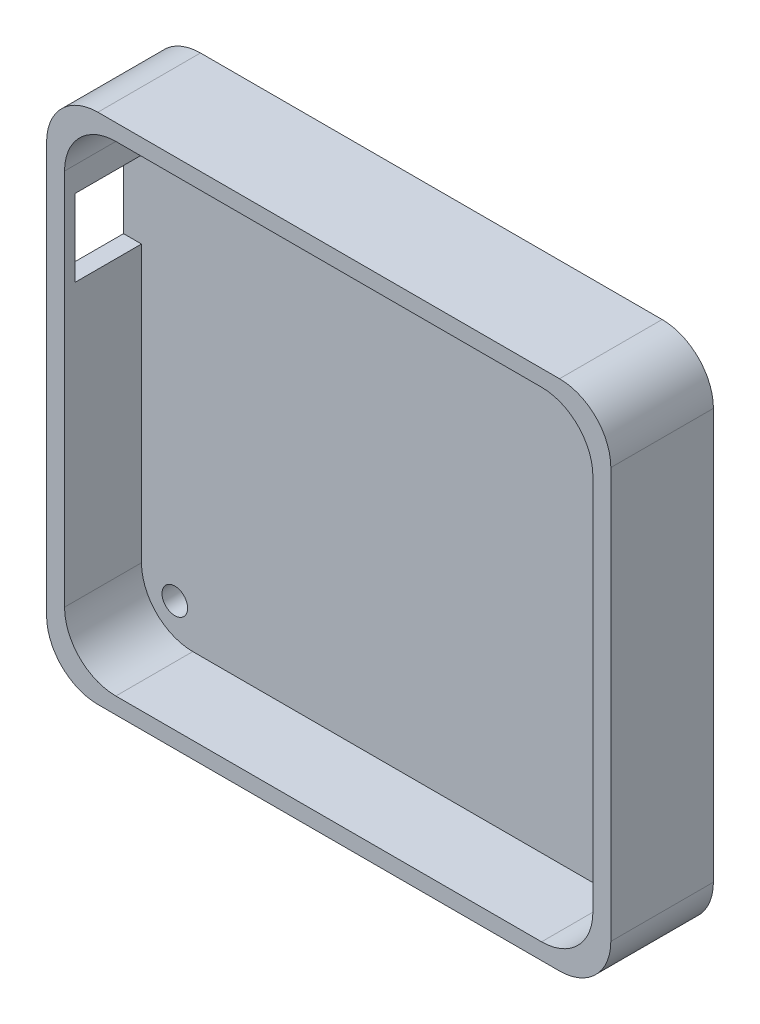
from build123d import *

# Parameters (mm, degrees)
SKETCH1_R           = 2.5
BOSS_EXTRUDE1_DEPTH = 5
BOSS_EXTRUDE2_DEPTH = 15
SKETCH4_W           = 13
SKETCH4_H           = 15
CUT_EXTRUDE1_DEPTH  = 6


with BuildPart() as part:
    # Sketch1 → Boss-Extrude1 (new body)
    with BuildSketch(Plane.XY):
        with BuildLine():
            Line((45, -50), (-45, -50))
            ThreePointArc((-45, -50), (-52.071067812, -47.071067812), (-55, -40))
            Line((-55, -40), (-55, 40))
            ThreePointArc((-55, 40), (-52.071067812, 47.071067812), (-45, 50))
            Line((-45, 50), (45, 50))
            ThreePointArc((45, 50), (52.071067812, 47.071067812), (55, 40))
            Line((55, 40), (55, -40))
            ThreePointArc((55, -40), (52.071067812, -47.071067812), (45, -50))
        make_face()
        with Locations((-45, 40)):
            Circle(SKETCH1_R, mode=Mode.SUBTRACT)
        with Locations(Location((-45, -40, 0), (0, 0, 180))):
            Circle(SKETCH1_R, mode=Mode.SUBTRACT)
        with Locations((45, -40)):
            Circle(SKETCH1_R, mode=Mode.SUBTRACT)
        with Locations(Location((45, 40, 0), (0, 0, 180))):
            Circle(SKETCH1_R, mode=Mode.SUBTRACT)
    extrude(amount=BOSS_EXTRUDE1_DEPTH)

    # Sketch2 → Boss-Extrude2 (add)
    with BuildSketch(Plane.XY.offset(5)):
        with BuildLine():
            Line((45, -50), (-45, -50))
            ThreePointArc((-45, -50), (-52.071067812, -47.071067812), (-55, -40))
            Line((-55, -40), (-55, 40))
            ThreePointArc((-55, 40), (-52.071067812, 47.071067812), (-45, 50))
            Line((-45, 50), (45, 50))
            ThreePointArc((45, 50), (52.071067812, 47.071067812), (55, 40))
            Line((55, 40), (55, -40))
            ThreePointArc((55, -40), (52.071067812, -47.071067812), (45, -50))
        make_face()
        with BuildLine():
            Line((41.5, -46.818181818), (-41.5, -46.818181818))
            ThreePointArc((-41.5, -46.818181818), (-48.571067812, -43.88924963), (-51.5, -36.818181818))
            Line((-51.5, -36.818181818), (-51.5, 36.818181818))
            ThreePointArc((-51.5, 36.818181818), (-48.571067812, 43.88924963), (-41.5, 46.818181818))
            Line((-41.5, 46.818181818), (41.5, 46.818181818))
            ThreePointArc((41.5, 46.818181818), (48.571067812, 43.88924963), (51.5, 36.818181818))
            Line((51.5, 36.818181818), (51.5, -36.818181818))
            ThreePointArc((51.5, -36.818181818), (48.571067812, -43.88924963), (41.5, -46.818181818))
        make_face(mode=Mode.SUBTRACT)
    extrude(amount=BOSS_EXTRUDE2_DEPTH)

    # Sketch4 → Cut-Extrude1 (cut)
    with BuildSketch(Plane.ZY.offset(55)):
        with Locations((11.5, 24.5)):
            Rectangle(SKETCH4_W, SKETCH4_H)
    extrude(amount=-CUT_EXTRUDE1_DEPTH, mode=Mode.SUBTRACT)


solid = part.part
